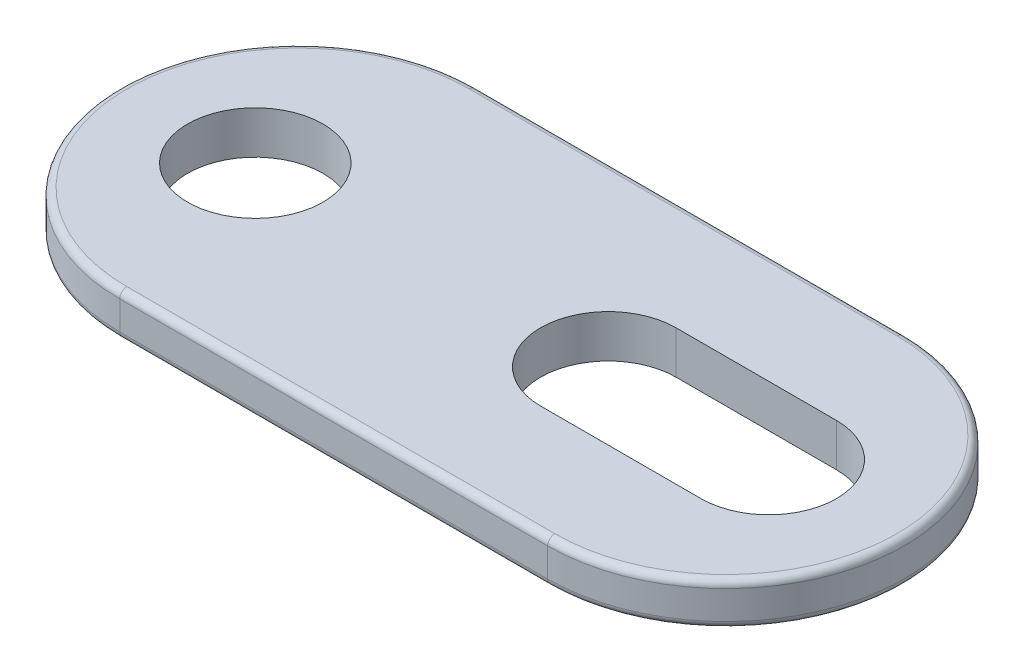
from build123d import *

# Parameters (mm, degrees)
SKETCH1_R      = 2.413
EXTRUDE1_DEPTH = 0.762
FILLET1_R      = 0.254


with BuildPart() as part:
    # Sketch1 → Extrude1 (new, symmetric)
    with BuildSketch(Plane(origin=(0, 0, 0), x_dir=(1, 0, 0), z_dir=(0, 1, 0))):
        with BuildLine():
            Line((1.524, -6.35), (16.764, -6.35))
            ThreePointArc((16.764, -6.35), (23.114, 0), (16.764, 6.35))
            Line((16.764, 6.35), (1.524, 6.35))
            ThreePointArc((1.524, 6.35), (-4.826, 0), (1.524, -6.35))
        make_face()
        with Locations(Location((0, 0, 0), (0, 0, 90))):
            Circle(SKETCH1_R, mode=Mode.SUBTRACT)
        with BuildLine():
            Line((12.573, 2.413), (18.288, 2.413))
            ThreePointArc((18.288, 2.413), (20.701, 0), (18.288, -2.413))
            Line((18.288, -2.413), (12.573, -2.413))
            ThreePointArc((12.573, -2.413), (10.16, 0), (12.573, 2.413))
        make_face(mode=Mode.SUBTRACT)
    extrude(amount=EXTRUDE1_DEPTH, both=True)

    # Fillet1
    fillet1_edges = [part.edges().sort_by_distance(p)[0] for p in [
        (23.114, 0.762, 0),
        (9.144, 0.762, -6.35),
        (-4.826, 0.762, 0),
        (9.144, -0.762, -6.35),
        (23.114, -0.762, 0),
        (9.144, -0.762, 6.35),
        (-4.826, -0.762, 0),
        (9.144, 0.762, 6.35),
    ]]
    fillet(fillet1_edges, radius=FILLET1_R)


solid = part.part
